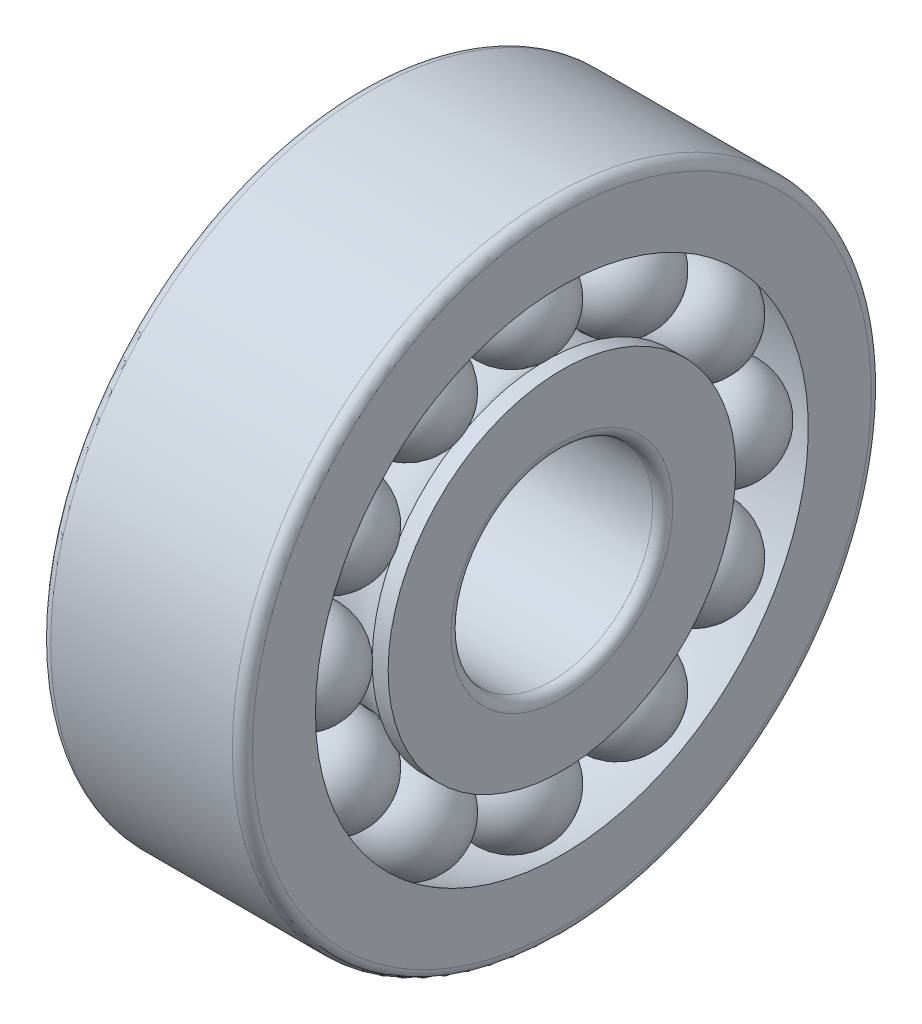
from build123d import *

# Parameters (mm, degrees)
CIRCULAR_PATTERN1_COUNT = 12
FILLET1_R               = 0.3


with BuildPart() as part:
    # Sketch1 → Revovle1 (revolve)
    with BuildSketch(Plane.XY, mode=Mode.PRIVATE) as revovle1_sk:
        with BuildLine():
            Line((-3, 3), (3, 3))
            Line((3, 3), (3, 5.166666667))
            Line((3, 5.166666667), (2.522980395, 5.166666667))
            ThreePointArc((2.522980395, 5.166666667), (1.5, 4.76), (0.477019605, 5.166666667))
            Line((0.477019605, 5.166666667), (-0.477019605, 5.166666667))
            ThreePointArc((-0.477019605, 5.166666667), (-1.5, 4.76), (-2.522980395, 5.166666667))
            Line((-2.522980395, 5.166666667), (-3, 5.166666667))
            Line((-3, 5.166666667), (-3, 3))
        make_face()
    revolve(revovle1_sk.sketch.rotate(Axis((0, 0, 0), (1, 0, 0)), 90), axis=Axis((0, 0, 0), (1, 0, 0)))

    # Sketch2 → Revolve2 (revolve)
    with BuildSketch(Plane.XY):
        with BuildLine():
            Line((-2.9995, 6.25), (-0.0005, 6.25))
            ThreePointArc((-0.0005, 6.25), (-1.5, 4.7505), (-2.9995, 6.25))
        make_face()
    revolve2 = revolve(axis=Axis((-4.033551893, 6.25, 0), (1, 0, 0)))

    # Mirror1: Revolve2 across plane
    add(revolve2.mirror(Plane(origin=(0, 0, 0), x_dir=(0, 0, 1), z_dir=(1, 0, 0))))

    # Sketch3 → Revolve3 (revolve)
    with BuildSketch(Plane.XY, mode=Mode.PRIVATE) as revolve3_sk:
        with BuildLine():
            Line((-3, 7.327106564), (-3, 9.5))
            Line((-3, 9.5), (3, 9.5))
            Line((3, 9.5), (3, 7.327106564))
            ThreePointArc((3, 7.327106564), (0, 7.917480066), (-3, 7.327106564))
        make_face()
    revolve(revolve3_sk.sketch.rotate(Axis((0, 0, 0), (1, 0, 0)), 90), axis=Axis((0, 0, 0), (1, 0, 0)))

    # Circular-Pattern1: Revolve2 ×12 about axis
    circular_pattern1_axis = Axis((0, 0, 0), (1, 0, 0))
    for i in range(1, CIRCULAR_PATTERN1_COUNT):
        add(revolve2.rotate(circular_pattern1_axis, i * 360 / CIRCULAR_PATTERN1_COUNT))

    # Circular-Pattern1 copy 1 sketch → Circular-Pattern1 copy 1 (revolve)
    with BuildSketch(Plane(origin=(0, 0, 0), x_dir=(-1, 0, 0), z_dir=(0, -0.49999999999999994, 0.8660254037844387))):
        with BuildLine():
            Line((-2.9995, -6.25), (-0.0005, -6.25))
            ThreePointArc((-0.0005, -6.25), (-1.5, -4.7505), (-2.9995, -6.25))
        make_face()
    revolve(axis=Axis((4.033551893, 5.412658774, 3.125), (1, 0, 0)))

    # Circular-Pattern1 copy 2 sketch → Circular-Pattern1 copy 2 (revolve)
    with BuildSketch(Plane(origin=(0, 0, 0), x_dir=(-1, 0, 0), z_dir=(0, -0.8660254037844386, 0.5000000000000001))):
        with BuildLine():
            Line((-2.9995, -6.25), (-0.0005, -6.25))
            ThreePointArc((-0.0005, -6.25), (-1.5, -4.7505), (-2.9995, -6.25))
        make_face()
    revolve(axis=Axis((4.033551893, 3.125, 5.412658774), (1, 0, 0)))

    # Circular-Pattern1 copy 3 sketch → Circular-Pattern1 copy 3 (revolve)
    with BuildSketch(Plane(origin=(0, 0, 0), x_dir=(-1, 0, 0), z_dir=(0, -1, 0))):
        with BuildLine():
            Line((-2.9995, -6.25), (-0.0005, -6.25))
            ThreePointArc((-0.0005, -6.25), (-1.5, -4.7505), (-2.9995, -6.25))
        make_face()
    revolve(axis=Axis((4.033551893, 0, 6.25), (1, 0, 0)))

    # Circular-Pattern1 copy 4 sketch → Circular-Pattern1 copy 4 (revolve)
    with BuildSketch(Plane(origin=(0, 0, 0), x_dir=(-1, 0, 0), z_dir=(0, -0.8660254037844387, -0.4999999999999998))):
        with BuildLine():
            Line((-2.9995, -6.25), (-0.0005, -6.25))
            ThreePointArc((-0.0005, -6.25), (-1.5, -4.7505), (-2.9995, -6.25))
        make_face()
    revolve(axis=Axis((4.033551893, -3.125, 5.412658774), (1, 0, 0)))

    # Circular-Pattern1 copy 5 sketch → Circular-Pattern1 copy 5 (revolve)
    with BuildSketch(Plane(origin=(0, 0, 0), x_dir=(-1, 0, 0), z_dir=(0, -0.49999999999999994, -0.8660254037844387))):
        with BuildLine():
            Line((-2.9995, -6.25), (-0.0005, -6.25))
            ThreePointArc((-0.0005, -6.25), (-1.5, -4.7505), (-2.9995, -6.25))
        make_face()
    revolve(axis=Axis((4.033551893, -5.412658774, 3.125), (1, 0, 0)))

    # Circular-Pattern1 copy 6 sketch → Circular-Pattern1 copy 6 (revolve)
    with BuildSketch(Plane(origin=(0, 0, 0), x_dir=(-1, 0, 0), z_dir=(0, 0, -1))):
        with BuildLine():
            Line((-2.9995, -6.25), (-0.0005, -6.25))
            ThreePointArc((-0.0005, -6.25), (-1.5, -4.7505), (-2.9995, -6.25))
        make_face()
    revolve(axis=Axis((4.033551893, -6.25, 0), (1, 0, 0)))

    # Circular-Pattern1 copy 7 sketch → Circular-Pattern1 copy 7 (revolve)
    with BuildSketch(Plane(origin=(0, 0, 0), x_dir=(-1, 0, 0), z_dir=(0, 0.5000000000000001, -0.8660254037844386))):
        with BuildLine():
            Line((-2.9995, -6.25), (-0.0005, -6.25))
            ThreePointArc((-0.0005, -6.25), (-1.5, -4.7505), (-2.9995, -6.25))
        make_face()
    revolve(axis=Axis((4.033551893, -5.412658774, -3.125), (1, 0, 0)))

    # Circular-Pattern1 copy 8 sketch → Circular-Pattern1 copy 8 (revolve)
    with BuildSketch(Plane(origin=(0, 0, 0), x_dir=(-1, 0, 0), z_dir=(0, 0.8660254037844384, -0.5000000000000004))):
        with BuildLine():
            Line((-2.9995, -6.25), (-0.0005, -6.25))
            ThreePointArc((-0.0005, -6.25), (-1.5, -4.7505), (-2.9995, -6.25))
        make_face()
    revolve(axis=Axis((4.033551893, -3.125, -5.412658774), (1, 0, 0)))

    # Circular-Pattern1 copy 9 sketch → Circular-Pattern1 copy 9 (revolve)
    with BuildSketch(Plane(origin=(0, 0, 0), x_dir=(-1, 0, 0), z_dir=(0, 1, 0))):
        with BuildLine():
            Line((-2.9995, -6.25), (-0.0005, -6.25))
            ThreePointArc((-0.0005, -6.25), (-1.5, -4.7505), (-2.9995, -6.25))
        make_face()
    revolve(axis=Axis((4.033551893, 0, -6.25), (1, 0, 0)))

    # Circular-Pattern1 copy 10 sketch → Circular-Pattern1 copy 10 (revolve)
    with BuildSketch(Plane(origin=(0, 0, 0), x_dir=(-1, 0, 0), z_dir=(0, 0.8660254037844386, 0.5000000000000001))):
        with BuildLine():
            Line((-2.9995, -6.25), (-0.0005, -6.25))
            ThreePointArc((-0.0005, -6.25), (-1.5, -4.7505), (-2.9995, -6.25))
        make_face()
    revolve(axis=Axis((4.033551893, 3.125, -5.412658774), (1, 0, 0)))

    # Circular-Pattern1 copy 11 sketch → Circular-Pattern1 copy 11 (revolve)
    with BuildSketch(Plane(origin=(0, 0, 0), x_dir=(-1, 0, 0), z_dir=(0, 0.5000000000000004, 0.8660254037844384))):
        with BuildLine():
            Line((-2.9995, -6.25), (-0.0005, -6.25))
            ThreePointArc((-0.0005, -6.25), (-1.5, -4.7505), (-2.9995, -6.25))
        make_face()
    revolve(axis=Axis((4.033551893, 5.412658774, -3.125), (1, 0, 0)))

    # Fillet1
    fillet1_edges = [part.edges().sort_by_distance(p)[0] for p in [
        (3, 0, -9.5),
        (-3, 0, -9.5),
        (3, 0, -3),
        (-3, 0, -3),
    ]]
    fillet(fillet1_edges, radius=FILLET1_R)


solid = part.part
